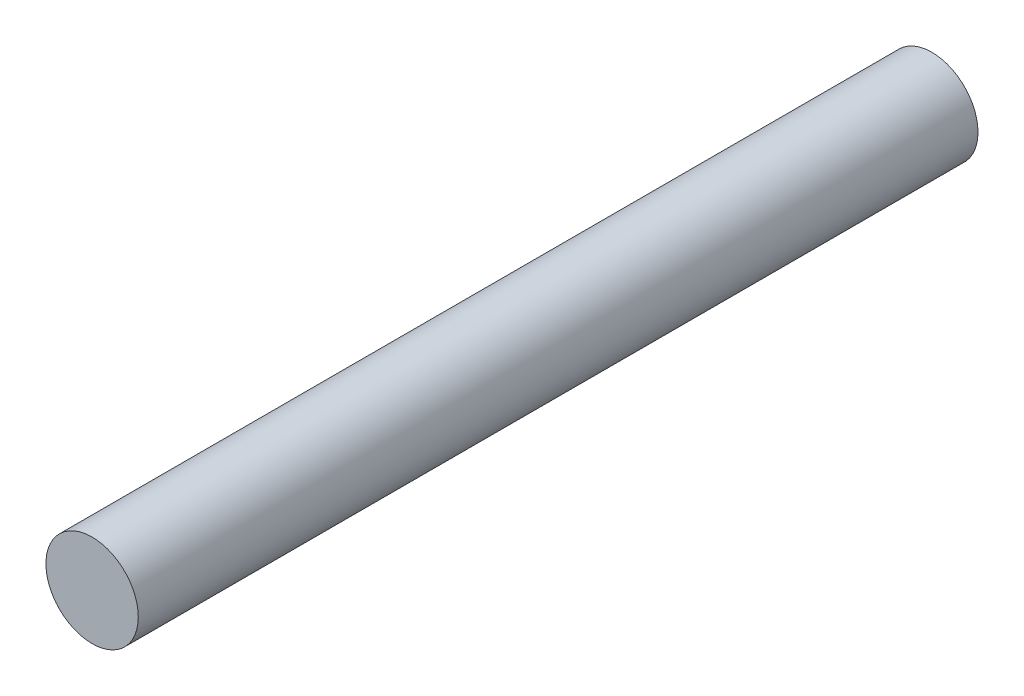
ISO-10303-21;
HEADER;
FILE_DESCRIPTION(('STEP AP214'),'2;1');
FILE_NAME('part.step','',(''),(''),'','','');
FILE_SCHEMA(('AUTOMOTIVE_DESIGN { 1 0 10303 214 1 1 1 1 }'));
ENDSEC;
DATA;
#1=APPLICATION_CONTEXT('core data for automotive mechanical design processes');
#2=APPLICATION_PROTOCOL_DEFINITION('international standard','automotive_design',2000,#1);
#3=PRODUCT_CONTEXT('',#1,'mechanical');
#4=PRODUCT('Part','Part','',(#3));
#5=PRODUCT_RELATED_PRODUCT_CATEGORY('part','',(#4));
#6=PRODUCT_DEFINITION_FORMATION('','',#4);
#7=PRODUCT_DEFINITION_CONTEXT('part definition',#1,'design');
#8=PRODUCT_DEFINITION('design','',#6,#7);
#9=PRODUCT_DEFINITION_SHAPE('','',#8);
#10=(LENGTH_UNIT() NAMED_UNIT(*) SI_UNIT(.MILLI.,.METRE.));
#11=(NAMED_UNIT(*) PLANE_ANGLE_UNIT() SI_UNIT($,.RADIAN.));
#12=(NAMED_UNIT(*) SI_UNIT($,.STERADIAN.) SOLID_ANGLE_UNIT());
#13=UNCERTAINTY_MEASURE_WITH_UNIT(LENGTH_MEASURE(1.E-05),#10,'distance_accuracy_value','');
#14=(GEOMETRIC_REPRESENTATION_CONTEXT(3) GLOBAL_UNCERTAINTY_ASSIGNED_CONTEXT((#13)) GLOBAL_UNIT_ASSIGNED_CONTEXT((#10,
#11,#12)) REPRESENTATION_CONTEXT('',''));
#15=CARTESIAN_POINT('',(0.,0.,0.));
#16=DIRECTION('',(0.,0.,1.));
#17=DIRECTION('',(1.,0.,0.));
#18=AXIS2_PLACEMENT_3D('',#15,#16,#17);
#19=CARTESIAN_POINT('',(0.,0.,5.));
#20=DIRECTION('',(0.,0.,-1.));
#21=DIRECTION('',(-1.,0.,0.));
#22=AXIS2_PLACEMENT_3D('',#19,#20,#21);
#23=CYLINDRICAL_SURFACE('',#22,0.55);
#24=CARTESIAN_POINT('',(0.,0.,5.));
#25=DIRECTION('',(0.,0.,1.));
#26=DIRECTION('',(1.,0.,0.));
#27=AXIS2_PLACEMENT_3D('',#24,#25,#26);
#28=CIRCLE('',#27,0.55);
#29=CARTESIAN_POINT('',(0.55,0.,5.));
#30=VERTEX_POINT('',#29);
#31=EDGE_CURVE('E10',#30,#30,#28,.T.);
#32=ORIENTED_EDGE('',*,*,#31,.F.);
#33=EDGE_LOOP('',(#32));
#34=FACE_BOUND('',#33,.T.);
#35=CARTESIAN_POINT('',(0.,0.,-5.));
#36=DIRECTION('',(0.,0.,1.));
#37=DIRECTION('',(1.,0.,0.));
#38=AXIS2_PLACEMENT_3D('',#35,#36,#37);
#39=CIRCLE('',#38,0.55);
#40=CARTESIAN_POINT('',(0.55,0.,-5.));
#41=VERTEX_POINT('',#40);
#42=EDGE_CURVE('E33',#41,#41,#39,.T.);
#43=ORIENTED_EDGE('',*,*,#42,.T.);
#44=EDGE_LOOP('',(#43));
#45=FACE_BOUND('',#44,.T.);
#46=ADVANCED_FACE('F30',(#34,#45),#23,.T.);
#47=CARTESIAN_POINT('',(0.,0.,5.));
#48=DIRECTION('',(0.,0.,1.));
#49=DIRECTION('',(1.,0.,0.));
#50=AXIS2_PLACEMENT_3D('',#47,#48,#49);
#51=PLANE('',#50);
#52=ORIENTED_EDGE('',*,*,#31,.T.);
#53=EDGE_LOOP('',(#52));
#54=FACE_BOUND('',#53,.T.);
#55=ADVANCED_FACE('F45',(#54),#51,.T.);
#56=CARTESIAN_POINT('',(0.,0.,-5.));
#57=DIRECTION('',(0.,0.,1.));
#58=DIRECTION('',(1.,0.,0.));
#59=AXIS2_PLACEMENT_3D('',#56,#57,#58);
#60=PLANE('',#59);
#61=ORIENTED_EDGE('',*,*,#42,.F.);
#62=EDGE_LOOP('',(#61));
#63=FACE_BOUND('',#62,.T.);
#64=ADVANCED_FACE('F43',(#63),#60,.F.);
#65=CLOSED_SHELL('',(#46,#55,#64));
#66=MANIFOLD_SOLID_BREP('B2',#65);
#67=ADVANCED_BREP_SHAPE_REPRESENTATION('',(#18,#66),#14);
#68=SHAPE_DEFINITION_REPRESENTATION(#9,#67);
ENDSEC;
END-ISO-10303-21;
